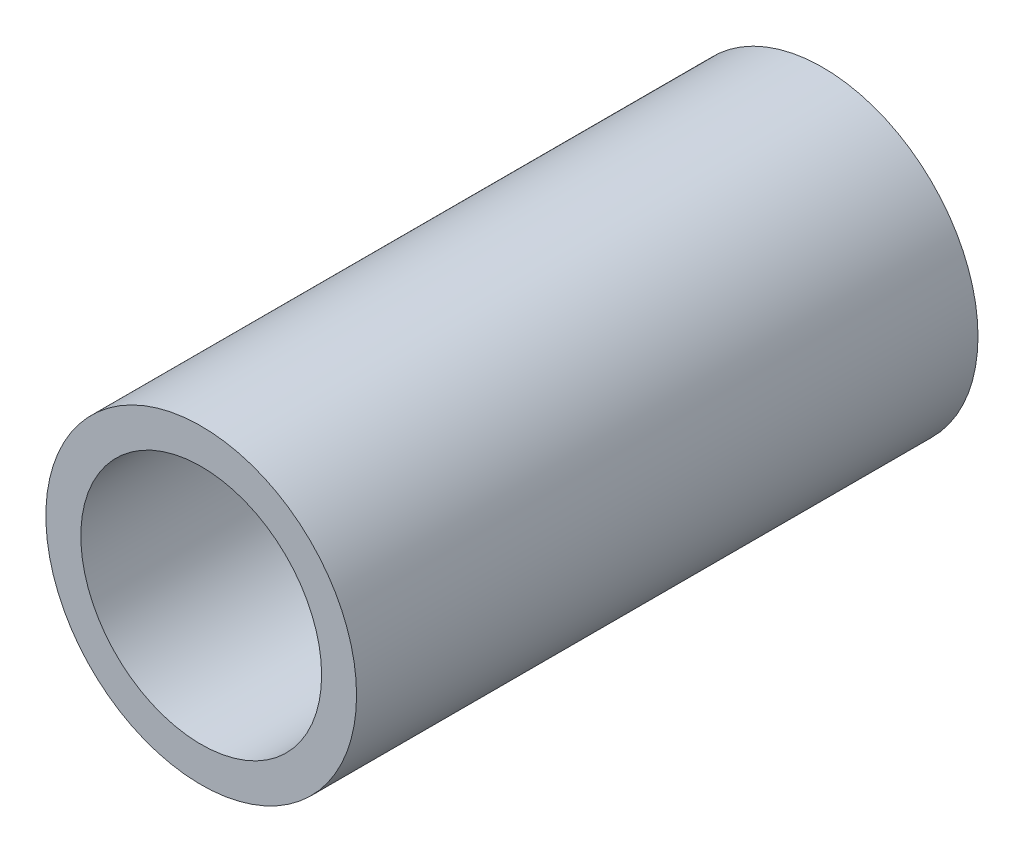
ISO-10303-21;
HEADER;
FILE_DESCRIPTION(('STEP AP214'),'2;1');
FILE_NAME('part.step','',(''),(''),'','','');
FILE_SCHEMA(('AUTOMOTIVE_DESIGN { 1 0 10303 214 1 1 1 1 }'));
ENDSEC;
DATA;
#1=APPLICATION_CONTEXT('core data for automotive mechanical design processes');
#2=APPLICATION_PROTOCOL_DEFINITION('international standard','automotive_design',2000,#1);
#3=PRODUCT_CONTEXT('',#1,'mechanical');
#4=PRODUCT('Part','Part','',(#3));
#5=PRODUCT_RELATED_PRODUCT_CATEGORY('part','',(#4));
#6=PRODUCT_DEFINITION_FORMATION('','',#4);
#7=PRODUCT_DEFINITION_CONTEXT('part definition',#1,'design');
#8=PRODUCT_DEFINITION('design','',#6,#7);
#9=PRODUCT_DEFINITION_SHAPE('','',#8);
#10=(LENGTH_UNIT() NAMED_UNIT(*) SI_UNIT(.MILLI.,.METRE.));
#11=(NAMED_UNIT(*) PLANE_ANGLE_UNIT() SI_UNIT($,.RADIAN.));
#12=(NAMED_UNIT(*) SI_UNIT($,.STERADIAN.) SOLID_ANGLE_UNIT());
#13=UNCERTAINTY_MEASURE_WITH_UNIT(LENGTH_MEASURE(1.E-05),#10,'distance_accuracy_value','');
#14=(GEOMETRIC_REPRESENTATION_CONTEXT(3) GLOBAL_UNCERTAINTY_ASSIGNED_CONTEXT((#13)) GLOBAL_UNIT_ASSIGNED_CONTEXT((#10,
#11,#12)) REPRESENTATION_CONTEXT('',''));
#15=CARTESIAN_POINT('',(0.,0.,0.));
#16=DIRECTION('',(0.,0.,1.));
#17=DIRECTION('',(1.,0.,0.));
#18=AXIS2_PLACEMENT_3D('',#15,#16,#17);
#19=CARTESIAN_POINT('',(0.,0.,8.));
#20=DIRECTION('',(0.,0.,1.));
#21=DIRECTION('',(1.,0.,0.));
#22=AXIS2_PLACEMENT_3D('',#19,#20,#21);
#23=PLANE('',#22);
#24=CARTESIAN_POINT('',(0.,0.,8.));
#25=DIRECTION('',(0.,0.,1.));
#26=DIRECTION('',(1.,0.,0.));
#27=AXIS2_PLACEMENT_3D('',#24,#25,#26);
#28=CIRCLE('',#27,2.);
#29=CARTESIAN_POINT('',(2.,0.,8.));
#30=VERTEX_POINT('',#29);
#31=EDGE_CURVE('E10',#30,#30,#28,.T.);
#32=ORIENTED_EDGE('',*,*,#31,.T.);
#33=EDGE_LOOP('',(#32));
#34=FACE_BOUND('',#33,.T.);
#35=CARTESIAN_POINT('',(0.,0.,8.));
#36=DIRECTION('',(0.,0.,1.));
#37=DIRECTION('',(1.,0.,0.));
#38=AXIS2_PLACEMENT_3D('',#35,#36,#37);
#39=CIRCLE('',#38,1.55);
#40=CARTESIAN_POINT('',(1.55,0.,8.));
#41=VERTEX_POINT('',#40);
#42=EDGE_CURVE('E35',#41,#41,#39,.T.);
#43=ORIENTED_EDGE('',*,*,#42,.F.);
#44=EDGE_LOOP('',(#43));
#45=FACE_BOUND('',#44,.T.);
#46=ADVANCED_FACE('F24',(#34,#45),#23,.T.);
#47=CARTESIAN_POINT('',(0.,0.,0.));
#48=DIRECTION('',(0.,0.,1.));
#49=DIRECTION('',(1.,0.,0.));
#50=AXIS2_PLACEMENT_3D('',#47,#48,#49);
#51=PLANE('',#50);
#52=CARTESIAN_POINT('',(0.,0.,0.));
#53=DIRECTION('',(0.,0.,1.));
#54=DIRECTION('',(1.,0.,0.));
#55=AXIS2_PLACEMENT_3D('',#52,#53,#54);
#56=CIRCLE('',#55,2.);
#57=CARTESIAN_POINT('',(2.,0.,0.));
#58=VERTEX_POINT('',#57);
#59=EDGE_CURVE('E31',#58,#58,#56,.T.);
#60=ORIENTED_EDGE('',*,*,#59,.F.);
#61=EDGE_LOOP('',(#60));
#62=FACE_BOUND('',#61,.T.);
#63=CARTESIAN_POINT('',(0.,0.,0.));
#64=DIRECTION('',(0.,0.,1.));
#65=DIRECTION('',(1.,0.,0.));
#66=AXIS2_PLACEMENT_3D('',#63,#64,#65);
#67=CIRCLE('',#66,1.55);
#68=CARTESIAN_POINT('',(1.55,0.,0.));
#69=VERTEX_POINT('',#68);
#70=EDGE_CURVE('E39',#69,#69,#67,.T.);
#71=ORIENTED_EDGE('',*,*,#70,.T.);
#72=EDGE_LOOP('',(#71));
#73=FACE_BOUND('',#72,.T.);
#74=ADVANCED_FACE('F45',(#62,#73),#51,.F.);
#75=CARTESIAN_POINT('',(0.,0.,8.));
#76=DIRECTION('',(0.,0.,-1.));
#77=DIRECTION('',(-1.,0.,0.));
#78=AXIS2_PLACEMENT_3D('',#75,#76,#77);
#79=CYLINDRICAL_SURFACE('',#78,2.);
#80=ORIENTED_EDGE('',*,*,#31,.F.);
#81=EDGE_LOOP('',(#80));
#82=FACE_BOUND('',#81,.T.);
#83=ORIENTED_EDGE('',*,*,#59,.T.);
#84=EDGE_LOOP('',(#83));
#85=FACE_BOUND('',#84,.T.);
#86=ADVANCED_FACE('F26',(#82,#85),#79,.T.);
#87=CARTESIAN_POINT('',(0.,0.,8.));
#88=DIRECTION('',(0.,0.,-1.));
#89=DIRECTION('',(-1.,0.,0.));
#90=AXIS2_PLACEMENT_3D('',#87,#88,#89);
#91=CYLINDRICAL_SURFACE('',#90,1.55);
#92=ORIENTED_EDGE('',*,*,#42,.T.);
#93=EDGE_LOOP('',(#92));
#94=FACE_BOUND('',#93,.T.);
#95=ORIENTED_EDGE('',*,*,#70,.F.);
#96=EDGE_LOOP('',(#95));
#97=FACE_BOUND('',#96,.T.);
#98=ADVANCED_FACE('F47',(#94,#97),#91,.F.);
#99=CLOSED_SHELL('',(#46,#74,#86,#98));
#100=MANIFOLD_SOLID_BREP('B2',#99);
#101=ADVANCED_BREP_SHAPE_REPRESENTATION('',(#18,#100),#14);
#102=SHAPE_DEFINITION_REPRESENTATION(#9,#101);
ENDSEC;
END-ISO-10303-21;
